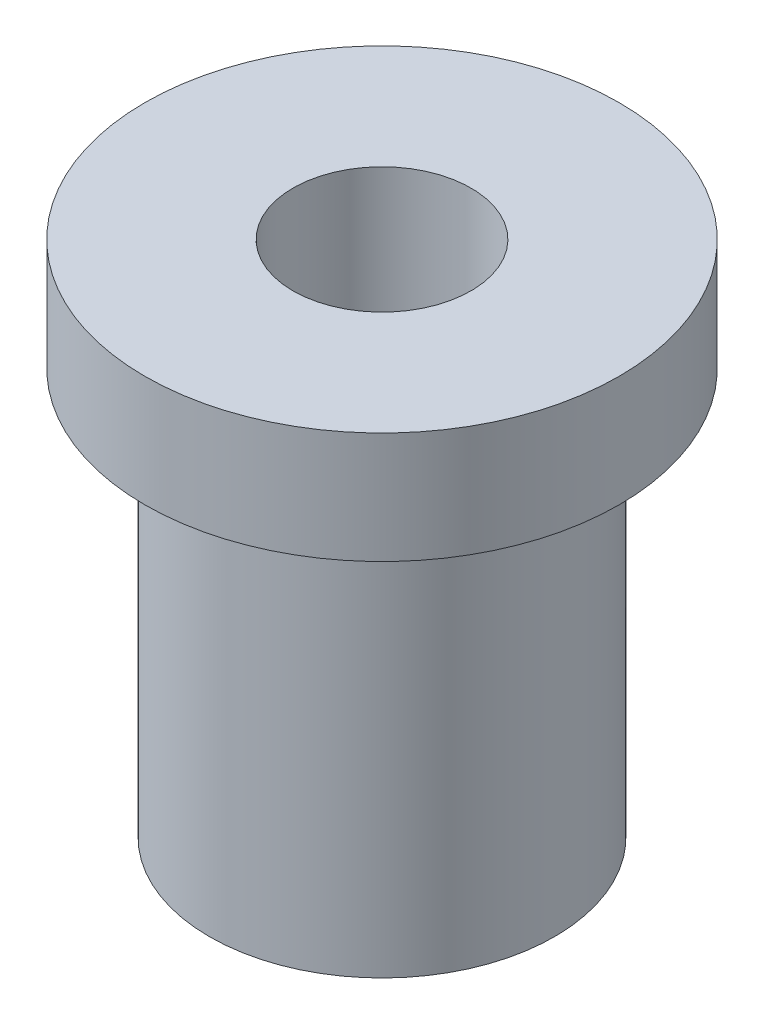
ISO-10303-21;
HEADER;
FILE_DESCRIPTION(('STEP AP214'),'2;1');
FILE_NAME('part.step','',(''),(''),'','','');
FILE_SCHEMA(('AUTOMOTIVE_DESIGN { 1 0 10303 214 1 1 1 1 }'));
ENDSEC;
DATA;
#1=APPLICATION_CONTEXT('core data for automotive mechanical design processes');
#2=APPLICATION_PROTOCOL_DEFINITION('international standard','automotive_design',2000,#1);
#3=PRODUCT_CONTEXT('',#1,'mechanical');
#4=PRODUCT('Part','Part','',(#3));
#5=PRODUCT_RELATED_PRODUCT_CATEGORY('part','',(#4));
#6=PRODUCT_DEFINITION_FORMATION('','',#4);
#7=PRODUCT_DEFINITION_CONTEXT('part definition',#1,'design');
#8=PRODUCT_DEFINITION('design','',#6,#7);
#9=PRODUCT_DEFINITION_SHAPE('','',#8);
#10=(LENGTH_UNIT() NAMED_UNIT(*) SI_UNIT(.MILLI.,.METRE.));
#11=(NAMED_UNIT(*) PLANE_ANGLE_UNIT() SI_UNIT($,.RADIAN.));
#12=(NAMED_UNIT(*) SI_UNIT($,.STERADIAN.) SOLID_ANGLE_UNIT());
#13=UNCERTAINTY_MEASURE_WITH_UNIT(LENGTH_MEASURE(1.E-05),#10,'distance_accuracy_value','');
#14=(GEOMETRIC_REPRESENTATION_CONTEXT(3) GLOBAL_UNCERTAINTY_ASSIGNED_CONTEXT((#13)) GLOBAL_UNIT_ASSIGNED_CONTEXT((#10,
#11,#12)) REPRESENTATION_CONTEXT('',''));
#15=CARTESIAN_POINT('',(0.,0.,0.));
#16=DIRECTION('',(0.,0.,1.));
#17=DIRECTION('',(1.,0.,0.));
#18=AXIS2_PLACEMENT_3D('',#15,#16,#17);
#19=CARTESIAN_POINT('',(0.,0.,0.));
#20=DIRECTION('',(0.,1.,0.));
#21=DIRECTION('',(0.,0.,1.));
#22=AXIS2_PLACEMENT_3D('',#19,#20,#21);
#23=PLANE('',#22);
#24=CARTESIAN_POINT('',(0.,0.,0.));
#25=DIRECTION('',(0.,1.,0.));
#26=DIRECTION('',(0.,0.,1.));
#27=AXIS2_PLACEMENT_3D('',#24,#25,#26);
#28=CIRCLE('',#27,3.1);
#29=CARTESIAN_POINT('',(0.,0.,3.1));
#30=VERTEX_POINT('',#29);
#31=EDGE_CURVE('E34',#30,#30,#28,.T.);
#32=ORIENTED_EDGE('',*,*,#31,.F.);
#33=EDGE_LOOP('',(#32));
#34=FACE_BOUND('',#33,.T.);
#35=CARTESIAN_POINT('',(0.,0.,0.));
#36=DIRECTION('',(0.,1.,0.));
#37=DIRECTION('',(0.,0.,1.));
#38=AXIS2_PLACEMENT_3D('',#35,#36,#37);
#39=CIRCLE('',#38,1.6);
#40=CARTESIAN_POINT('',(0.,0.,1.6));
#41=VERTEX_POINT('',#40);
#42=EDGE_CURVE('E41',#41,#41,#39,.T.);
#43=ORIENTED_EDGE('',*,*,#42,.T.);
#44=EDGE_LOOP('',(#43));
#45=FACE_BOUND('',#44,.T.);
#46=ADVANCED_FACE('F30',(#34,#45),#23,.F.);
#47=CARTESIAN_POINT('',(0.,7.3,0.));
#48=DIRECTION('',(0.,-1.,0.));
#49=DIRECTION('',(0.,0.,-1.));
#50=AXIS2_PLACEMENT_3D('',#47,#48,#49);
#51=CYLINDRICAL_SURFACE('',#50,3.1);
#52=CARTESIAN_POINT('',(0.,7.3,0.));
#53=DIRECTION('',(0.,1.,0.));
#54=DIRECTION('',(0.,0.,1.));
#55=AXIS2_PLACEMENT_3D('',#52,#53,#54);
#56=CIRCLE('',#55,3.1);
#57=CARTESIAN_POINT('',(0.,7.3,3.1));
#58=VERTEX_POINT('',#57);
#59=EDGE_CURVE('E10',#58,#58,#56,.T.);
#60=ORIENTED_EDGE('',*,*,#59,.F.);
#61=EDGE_LOOP('',(#60));
#62=FACE_BOUND('',#61,.T.);
#63=ORIENTED_EDGE('',*,*,#31,.T.);
#64=EDGE_LOOP('',(#63));
#65=FACE_BOUND('',#64,.T.);
#66=ADVANCED_FACE('F32',(#62,#65),#51,.T.);
#67=CARTESIAN_POINT('',(0.,7.3,0.));
#68=DIRECTION('',(0.,-1.,0.));
#69=DIRECTION('',(0.,0.,-1.));
#70=AXIS2_PLACEMENT_3D('',#67,#68,#69);
#71=CYLINDRICAL_SURFACE('',#70,1.6);
#72=ORIENTED_EDGE('',*,*,#42,.F.);
#73=EDGE_LOOP('',(#72));
#74=FACE_BOUND('',#73,.T.);
#75=CARTESIAN_POINT('',(0.,9.3,0.));
#76=DIRECTION('',(0.,1.,0.));
#77=DIRECTION('',(0.,0.,1.));
#78=AXIS2_PLACEMENT_3D('',#75,#76,#77);
#79=CIRCLE('',#78,1.6);
#80=CARTESIAN_POINT('',(0.,9.3,1.6));
#81=VERTEX_POINT('',#80);
#82=EDGE_CURVE('E49',#81,#81,#79,.T.);
#83=ORIENTED_EDGE('',*,*,#82,.T.);
#84=EDGE_LOOP('',(#83));
#85=FACE_BOUND('',#84,.T.);
#86=ADVANCED_FACE('F55',(#74,#85),#71,.F.);
#87=CARTESIAN_POINT('',(0.,7.3,0.));
#88=DIRECTION('',(0.,1.,0.));
#89=DIRECTION('',(0.,0.,1.));
#90=AXIS2_PLACEMENT_3D('',#87,#88,#89);
#91=PLANE('',#90);
#92=CARTESIAN_POINT('',(0.,7.3,0.));
#93=DIRECTION('',(0.,1.,0.));
#94=DIRECTION('',(0.,0.,1.));
#95=AXIS2_PLACEMENT_3D('',#92,#93,#94);
#96=CIRCLE('',#95,4.26);
#97=CARTESIAN_POINT('',(0.,7.3,4.26));
#98=VERTEX_POINT('',#97);
#99=EDGE_CURVE('E46',#98,#98,#96,.T.);
#100=ORIENTED_EDGE('',*,*,#99,.F.);
#101=EDGE_LOOP('',(#100));
#102=FACE_BOUND('',#101,.T.);
#103=ORIENTED_EDGE('',*,*,#59,.T.);
#104=EDGE_LOOP('',(#103));
#105=FACE_BOUND('',#104,.T.);
#106=ADVANCED_FACE('F60',(#102,#105),#91,.F.);
#107=CARTESIAN_POINT('',(0.,9.3,0.));
#108=DIRECTION('',(0.,1.,0.));
#109=DIRECTION('',(0.,0.,1.));
#110=AXIS2_PLACEMENT_3D('',#107,#108,#109);
#111=PLANE('',#110);
#112=CARTESIAN_POINT('',(0.,9.3,0.));
#113=DIRECTION('',(0.,1.,0.));
#114=DIRECTION('',(0.,0.,1.));
#115=AXIS2_PLACEMENT_3D('',#112,#113,#114);
#116=CIRCLE('',#115,4.26);
#117=CARTESIAN_POINT('',(0.,9.3,4.26));
#118=VERTEX_POINT('',#117);
#119=EDGE_CURVE('E45',#118,#118,#116,.T.);
#120=ORIENTED_EDGE('',*,*,#119,.T.);
#121=EDGE_LOOP('',(#120));
#122=FACE_BOUND('',#121,.T.);
#123=ORIENTED_EDGE('',*,*,#82,.F.);
#124=EDGE_LOOP('',(#123));
#125=FACE_BOUND('',#124,.T.);
#126=ADVANCED_FACE('F57',(#122,#125),#111,.T.);
#127=CARTESIAN_POINT('',(0.,9.3,0.));
#128=DIRECTION('',(0.,-1.,0.));
#129=DIRECTION('',(0.,0.,-1.));
#130=AXIS2_PLACEMENT_3D('',#127,#128,#129);
#131=CYLINDRICAL_SURFACE('',#130,4.26);
#132=ORIENTED_EDGE('',*,*,#119,.F.);
#133=EDGE_LOOP('',(#132));
#134=FACE_BOUND('',#133,.T.);
#135=ORIENTED_EDGE('',*,*,#99,.T.);
#136=EDGE_LOOP('',(#135));
#137=FACE_BOUND('',#136,.T.);
#138=ADVANCED_FACE('F59',(#134,#137),#131,.T.);
#139=CLOSED_SHELL('',(#46,#66,#86,#106,#126,#138));
#140=MANIFOLD_SOLID_BREP('B2',#139);
#141=ADVANCED_BREP_SHAPE_REPRESENTATION('',(#18,#140),#14);
#142=SHAPE_DEFINITION_REPRESENTATION(#9,#141);
ENDSEC;
END-ISO-10303-21;
